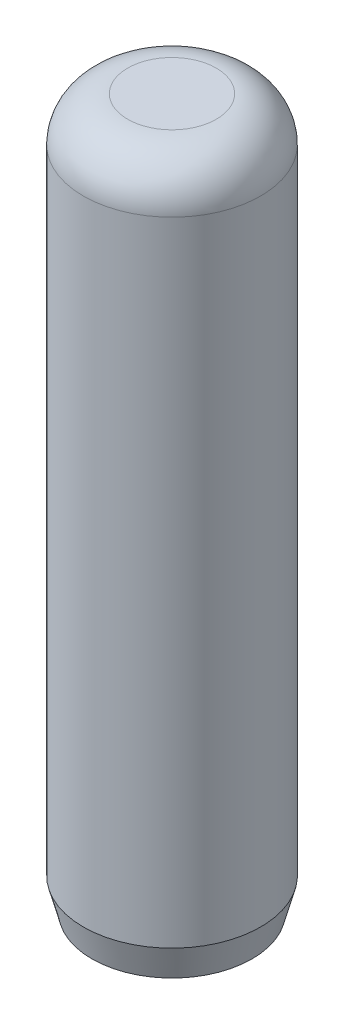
ISO-10303-21;
HEADER;
FILE_DESCRIPTION(('STEP AP214'),'2;1');
FILE_NAME('part.step','',(''),(''),'','','');
FILE_SCHEMA(('AUTOMOTIVE_DESIGN { 1 0 10303 214 1 1 1 1 }'));
ENDSEC;
DATA;
#1=APPLICATION_CONTEXT('core data for automotive mechanical design processes');
#2=APPLICATION_PROTOCOL_DEFINITION('international standard','automotive_design',2000,#1);
#3=PRODUCT_CONTEXT('',#1,'mechanical');
#4=PRODUCT('Part','Part','',(#3));
#5=PRODUCT_RELATED_PRODUCT_CATEGORY('part','',(#4));
#6=PRODUCT_DEFINITION_FORMATION('','',#4);
#7=PRODUCT_DEFINITION_CONTEXT('part definition',#1,'design');
#8=PRODUCT_DEFINITION('design','',#6,#7);
#9=PRODUCT_DEFINITION_SHAPE('','',#8);
#10=(LENGTH_UNIT() NAMED_UNIT(*) SI_UNIT(.MILLI.,.METRE.));
#11=(NAMED_UNIT(*) PLANE_ANGLE_UNIT() SI_UNIT($,.RADIAN.));
#12=(NAMED_UNIT(*) SI_UNIT($,.STERADIAN.) SOLID_ANGLE_UNIT());
#13=UNCERTAINTY_MEASURE_WITH_UNIT(LENGTH_MEASURE(1.E-05),#10,'distance_accuracy_value','');
#14=(GEOMETRIC_REPRESENTATION_CONTEXT(3) GLOBAL_UNCERTAINTY_ASSIGNED_CONTEXT((#13)) GLOBAL_UNIT_ASSIGNED_CONTEXT((#10,
#11,#12)) REPRESENTATION_CONTEXT('',''));
#15=CARTESIAN_POINT('',(0.,0.,0.));
#16=DIRECTION('',(0.,0.,1.));
#17=DIRECTION('',(1.,0.,0.));
#18=AXIS2_PLACEMENT_3D('',#15,#16,#17);
#19=CARTESIAN_POINT('',(0.00380999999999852,11.90625,0.));
#20=DIRECTION('',(0.,-1.,0.));
#21=DIRECTION('',(0.,0.,-1.));
#22=AXIS2_PLACEMENT_3D('',#19,#20,#21);
#23=TOROIDAL_SURFACE('',#22,0.79375,0.79375);
#24=CARTESIAN_POINT('',(0.00380999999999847,12.7,0.));
#25=DIRECTION('',(0.,-1.,0.));
#26=DIRECTION('',(0.,0.,-1.));
#27=AXIS2_PLACEMENT_3D('',#24,#25,#26);
#28=CIRCLE('',#27,0.793749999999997);
#29=CARTESIAN_POINT('',(0.00380999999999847,12.7,-0.793749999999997));
#30=VERTEX_POINT('',#29);
#31=EDGE_CURVE('E10',#30,#30,#28,.T.);
#32=ORIENTED_EDGE('',*,*,#31,.T.);
#33=EDGE_LOOP('',(#32));
#34=FACE_BOUND('',#33,.T.);
#35=CARTESIAN_POINT('',(0.00380999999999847,11.90625,0.));
#36=DIRECTION('',(0.,-1.,0.));
#37=DIRECTION('',(0.,0.,-1.));
#38=AXIS2_PLACEMENT_3D('',#35,#36,#37);
#39=CIRCLE('',#38,1.5875);
#40=CARTESIAN_POINT('',(0.00380999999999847,11.90625,-1.5875));
#41=VERTEX_POINT('',#40);
#42=EDGE_CURVE('E48',#41,#41,#39,.T.);
#43=ORIENTED_EDGE('',*,*,#42,.F.);
#44=EDGE_LOOP('',(#43));
#45=FACE_BOUND('',#44,.T.);
#46=ADVANCED_FACE('F34',(#34,#45),#23,.T.);
#47=CARTESIAN_POINT('',(0.00380999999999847,12.7,0.));
#48=DIRECTION('',(0.,-1.,0.));
#49=DIRECTION('',(0.,0.,-1.));
#50=AXIS2_PLACEMENT_3D('',#47,#48,#49);
#51=PLANE('',#50);
#52=ORIENTED_EDGE('',*,*,#31,.F.);
#53=EDGE_LOOP('',(#52));
#54=FACE_BOUND('',#53,.T.);
#55=ADVANCED_FACE('F57',(#54),#51,.F.);
#56=CARTESIAN_POINT('',(1.43801382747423,0.,0.));
#57=DIRECTION('',(0.,1.,0.));
#58=DIRECTION('',(0.,0.,1.));
#59=AXIS2_PLACEMENT_3D('',#56,#57,#58);
#60=PLANE('',#59);
#61=CARTESIAN_POINT('',(0.00380999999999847,0.,0.));
#62=DIRECTION('',(0.,-1.,0.));
#63=DIRECTION('',(0.,0.,-1.));
#64=AXIS2_PLACEMENT_3D('',#61,#62,#63);
#65=CIRCLE('',#64,1.43420382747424);
#66=CARTESIAN_POINT('',(0.00380999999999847,0.,-1.43420382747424));
#67=VERTEX_POINT('',#66);
#68=EDGE_CURVE('E40',#67,#67,#65,.T.);
#69=ORIENTED_EDGE('',*,*,#68,.T.);
#70=EDGE_LOOP('',(#69));
#71=FACE_BOUND('',#70,.T.);
#72=ADVANCED_FACE('F61',(#71),#60,.F.);
#73=CARTESIAN_POINT('',(0.00380999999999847,0.572109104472,0.));
#74=DIRECTION('',(0.,1.,0.));
#75=DIRECTION('',(0.,0.,1.));
#76=AXIS2_PLACEMENT_3D('',#73,#74,#75);
#77=CONICAL_SURFACE('',#76,1.5875,0.261799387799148);
#78=ORIENTED_EDGE('',*,*,#68,.F.);
#79=EDGE_LOOP('',(#78));
#80=FACE_BOUND('',#79,.T.);
#81=CARTESIAN_POINT('',(0.00380999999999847,0.572109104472,0.));
#82=DIRECTION('',(0.,-1.,0.));
#83=DIRECTION('',(0.,0.,-1.));
#84=AXIS2_PLACEMENT_3D('',#81,#82,#83);
#85=CIRCLE('',#84,1.5875);
#86=CARTESIAN_POINT('',(0.00380999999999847,0.572109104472,-1.5875));
#87=VERTEX_POINT('',#86);
#88=EDGE_CURVE('E44',#87,#87,#85,.T.);
#89=ORIENTED_EDGE('',*,*,#88,.T.);
#90=EDGE_LOOP('',(#89));
#91=FACE_BOUND('',#90,.T.);
#92=ADVANCED_FACE('F66',(#80,#91),#77,.T.);
#93=CARTESIAN_POINT('',(0.00380999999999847,0.,0.));
#94=DIRECTION('',(0.,-1.,0.));
#95=DIRECTION('',(0.,0.,-1.));
#96=AXIS2_PLACEMENT_3D('',#93,#94,#95);
#97=CYLINDRICAL_SURFACE('',#96,1.5875);
#98=ORIENTED_EDGE('',*,*,#88,.F.);
#99=EDGE_LOOP('',(#98));
#100=FACE_BOUND('',#99,.T.);
#101=ORIENTED_EDGE('',*,*,#42,.T.);
#102=EDGE_LOOP('',(#101));
#103=FACE_BOUND('',#102,.T.);
#104=ADVANCED_FACE('F54',(#100,#103),#97,.T.);
#105=CLOSED_SHELL('',(#46,#55,#72,#92,#104));
#106=MANIFOLD_SOLID_BREP('B2',#105);
#107=ADVANCED_BREP_SHAPE_REPRESENTATION('',(#18,#106),#14);
#108=SHAPE_DEFINITION_REPRESENTATION(#9,#107);
ENDSEC;
END-ISO-10303-21;
